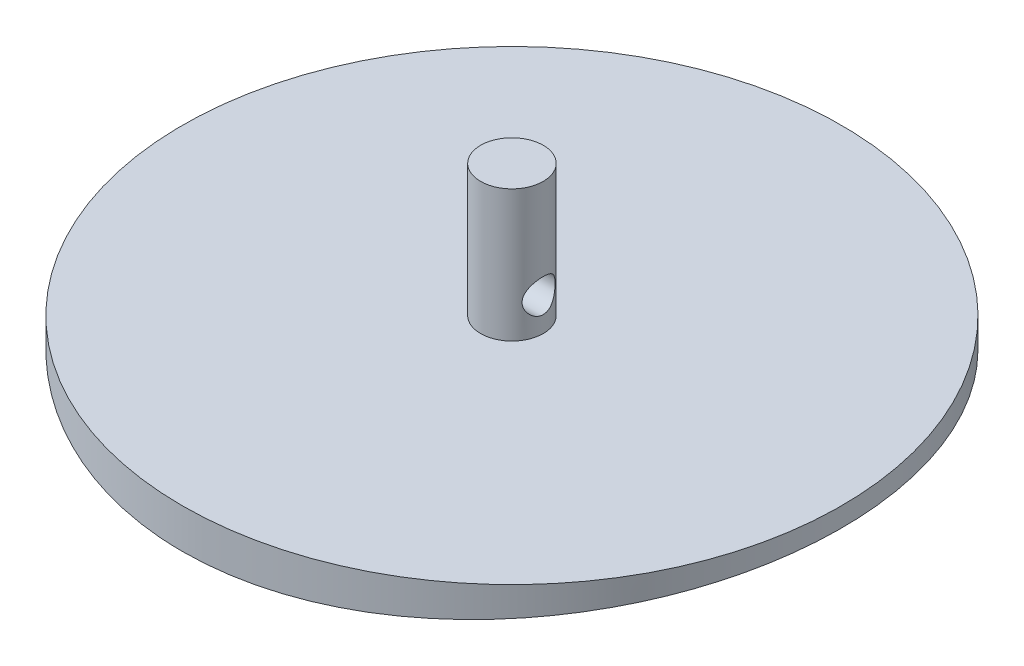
ISO-10303-21;
HEADER;
FILE_DESCRIPTION(('STEP AP214'),'2;1');
FILE_NAME('part.step','',(''),(''),'','','');
FILE_SCHEMA(('AUTOMOTIVE_DESIGN { 1 0 10303 214 1 1 1 1 }'));
ENDSEC;
DATA;
#1=APPLICATION_CONTEXT('core data for automotive mechanical design processes');
#2=APPLICATION_PROTOCOL_DEFINITION('international standard','automotive_design',2000,#1);
#3=PRODUCT_CONTEXT('',#1,'mechanical');
#4=PRODUCT('Part','Part','',(#3));
#5=PRODUCT_RELATED_PRODUCT_CATEGORY('part','',(#4));
#6=PRODUCT_DEFINITION_FORMATION('','',#4);
#7=PRODUCT_DEFINITION_CONTEXT('part definition',#1,'design');
#8=PRODUCT_DEFINITION('design','',#6,#7);
#9=PRODUCT_DEFINITION_SHAPE('','',#8);
#10=(LENGTH_UNIT() NAMED_UNIT(*) SI_UNIT(.MILLI.,.METRE.));
#11=(NAMED_UNIT(*) PLANE_ANGLE_UNIT() SI_UNIT($,.RADIAN.));
#12=(NAMED_UNIT(*) SI_UNIT($,.STERADIAN.) SOLID_ANGLE_UNIT());
#13=UNCERTAINTY_MEASURE_WITH_UNIT(LENGTH_MEASURE(1.E-05),#10,'distance_accuracy_value','');
#14=(GEOMETRIC_REPRESENTATION_CONTEXT(3) GLOBAL_UNCERTAINTY_ASSIGNED_CONTEXT((#13)) GLOBAL_UNIT_ASSIGNED_CONTEXT((#10,
#11,#12)) REPRESENTATION_CONTEXT('',''));
#15=CARTESIAN_POINT('',(0.,0.,0.));
#16=DIRECTION('',(0.,0.,1.));
#17=DIRECTION('',(1.,0.,0.));
#18=AXIS2_PLACEMENT_3D('',#15,#16,#17);
#19=CARTESIAN_POINT('',(0.,6.,0.));
#20=DIRECTION('',(0.,-1.,0.));
#21=DIRECTION('',(0.,0.,-1.));
#22=AXIS2_PLACEMENT_3D('',#19,#20,#21);
#23=CYLINDRICAL_SURFACE('',#22,50.);
#24=CARTESIAN_POINT('',(0.,6.,0.));
#25=DIRECTION('',(0.,1.,0.));
#26=DIRECTION('',(0.,0.,1.));
#27=AXIS2_PLACEMENT_3D('',#24,#25,#26);
#28=CIRCLE('',#27,50.);
#29=CARTESIAN_POINT('',(0.,6.,50.));
#30=VERTEX_POINT('',#29);
#31=EDGE_CURVE('E10',#30,#30,#28,.T.);
#32=ORIENTED_EDGE('',*,*,#31,.F.);
#33=EDGE_LOOP('',(#32));
#34=FACE_BOUND('',#33,.T.);
#35=CARTESIAN_POINT('',(0.,0.,50.));
#36=CARTESIAN_POINT('',(1.39795388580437,2.42831574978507E-06,49.999992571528));
#37=CARTESIAN_POINT('',(2.79613078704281,0.0072386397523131,49.9413223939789));
#38=CARTESIAN_POINT('',(5.58305158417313,0.0359875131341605,49.7070057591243));
#39=CARTESIAN_POINT('',(6.97179065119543,0.0575069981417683,49.5313033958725));
#40=CARTESIAN_POINT('',(9.73204390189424,0.114260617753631,49.0637366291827));
#41=CARTESIAN_POINT('',(11.1035202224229,0.149520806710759,48.7716515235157));
#42=CARTESIAN_POINT('',(13.8165716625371,0.232733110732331,48.0735291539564));
#43=CARTESIAN_POINT('',(15.1581503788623,0.280683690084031,47.6675056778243));
#44=CARTESIAN_POINT('',(17.8007431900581,0.387847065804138,46.7449476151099));
#45=CARTESIAN_POINT('',(19.101797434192,0.447048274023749,46.2285266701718));
#46=CARTESIAN_POINT('',(21.6556901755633,0.575058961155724,45.0886524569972));
#47=CARTESIAN_POINT('',(22.9085272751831,0.643868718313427,44.465196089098));
#48=CARTESIAN_POINT('',(25.3566857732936,0.78911193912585,43.1160188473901));
#49=CARTESIAN_POINT('',(26.5520320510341,0.865542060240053,42.390342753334));
#50=CARTESIAN_POINT('',(28.8775150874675,1.02389577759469,40.8416541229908));
#51=CARTESIAN_POINT('',(30.0076520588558,1.10581935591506,40.0186419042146));
#52=CARTESIAN_POINT('',(32.2002711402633,1.27326913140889,38.276787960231));
#53=CARTESIAN_POINT('',(33.2623958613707,1.35881096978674,37.3574978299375));
#54=CARTESIAN_POINT('',(35.3055348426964,1.53070447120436,35.4328784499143));
#55=CARTESIAN_POINT('',(36.2865487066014,1.61705613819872,34.4275487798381));
#56=CARTESIAN_POINT('',(38.1607026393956,1.78814404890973,32.3377623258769));
#57=CARTESIAN_POINT('',(39.0538341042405,1.87288013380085,31.2532978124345));
#58=CARTESIAN_POINT('',(40.7458370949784,2.03834231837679,29.0128823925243));
#59=CARTESIAN_POINT('',(41.5447085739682,2.11906841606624,27.8569314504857));
#60=CARTESIAN_POINT('',(43.04488702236,2.27448156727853,25.4778633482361));
#61=CARTESIAN_POINT('',(43.7458790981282,2.34914881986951,24.2545462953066));
#62=CARTESIAN_POINT('',(45.0422558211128,2.49004170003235,21.7527041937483));
#63=CARTESIAN_POINT('',(45.6376401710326,2.55626730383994,20.4741789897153));
#64=CARTESIAN_POINT('',(46.7184353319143,2.67839148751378,17.8710334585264));
#65=CARTESIAN_POINT('',(47.2038501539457,2.73429044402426,16.5464148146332));
#66=CARTESIAN_POINT('',(48.0611473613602,2.83417079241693,13.8604963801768));
#67=CARTESIAN_POINT('',(48.4330303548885,2.87815224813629,12.4991967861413));
#68=CARTESIAN_POINT('',(49.0589202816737,2.95275416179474,9.75658023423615));
#69=CARTESIAN_POINT('',(49.3135078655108,2.98344038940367,8.37539756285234));
#70=CARTESIAN_POINT('',(49.7056430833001,3.03090101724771,5.5962789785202));
#71=CARTESIAN_POINT('',(49.8431910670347,3.04767545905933,4.19834311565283));
#72=CARTESIAN_POINT('',(50.0002140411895,3.06683602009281,1.3958017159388));
#73=CARTESIAN_POINT('',(50.0196927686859,3.06922259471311,-0.00880360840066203));
#74=CARTESIAN_POINT('',(49.9404405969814,3.05954078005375,-2.81462294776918));
#75=CARTESIAN_POINT('',(49.8417100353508,3.04747243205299,-4.21583697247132));
#76=CARTESIAN_POINT('',(49.527625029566,3.00932624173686,-6.99733852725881));
#77=CARTESIAN_POINT('',(49.3128971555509,2.98332367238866,-8.37769789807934));
#78=CARTESIAN_POINT('',(48.7688165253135,2.91808726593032,-11.1153121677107));
#79=CARTESIAN_POINT('',(48.4394642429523,2.87885348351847,-12.4725671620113));
#80=CARTESIAN_POINT('',(47.6685415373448,2.78825238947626,-15.1544345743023));
#81=CARTESIAN_POINT('',(47.2269686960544,2.7368848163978,-16.4790462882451));
#82=CARTESIAN_POINT('',(46.2348131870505,2.62345171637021,-19.0863206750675));
#83=CARTESIAN_POINT('',(45.6842300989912,2.56138614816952,-20.368983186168));
#84=CARTESIAN_POINT('',(44.4764303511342,2.42811300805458,-22.8867137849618));
#85=CARTESIAN_POINT('',(43.8189391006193,2.35688199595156,-24.1216488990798));
#86=CARTESIAN_POINT('',(42.4030366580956,2.20739602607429,-26.5317902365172));
#87=CARTESIAN_POINT('',(41.6446253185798,2.12914105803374,-27.706996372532));
#88=CARTESIAN_POINT('',(40.0322643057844,1.96779475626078,-29.989500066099));
#89=CARTESIAN_POINT('',(39.1783187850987,1.88470363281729,-31.0968005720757));
#90=CARTESIAN_POINT('',(37.3808252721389,1.71599927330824,-33.2359085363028));
#91=CARTESIAN_POINT('',(36.4372770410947,1.63038603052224,-34.2677157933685));
#92=CARTESIAN_POINT('',(34.4608585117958,1.45848199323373,-36.2550071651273));
#93=CARTESIAN_POINT('',(33.4274591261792,1.37219034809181,-37.209965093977));
#94=CARTESIAN_POINT('',(31.2837558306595,1.2019145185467,-39.0295171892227));
#95=CARTESIAN_POINT('',(30.1734509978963,1.11793036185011,-39.8941102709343));
#96=CARTESIAN_POINT('',(27.8831620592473,0.954616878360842,-41.527199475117));
#97=CARTESIAN_POINT('',(26.7031452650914,0.875289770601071,-42.2956499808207));
#98=CARTESIAN_POINT('',(24.2822179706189,0.723600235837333,-43.7304666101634));
#99=CARTESIAN_POINT('',(23.0413093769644,0.651237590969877,-44.3968359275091));
#100=CARTESIAN_POINT('',(20.50581829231,0.515470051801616,-45.6234266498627));
#101=CARTESIAN_POINT('',(19.2111745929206,0.452075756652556,-46.1835227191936));
#102=CARTESIAN_POINT('',(16.5785988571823,0.336170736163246,-47.1925562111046));
#103=CARTESIAN_POINT('',(15.2406614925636,0.283661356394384,-47.6414798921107));
#104=CARTESIAN_POINT('',(12.5339035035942,0.191151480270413,-48.4239850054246));
#105=CARTESIAN_POINT('',(11.1651480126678,0.151126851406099,-48.757789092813));
#106=CARTESIAN_POINT('',(8.4045820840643,0.084628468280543,-49.3086458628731));
#107=CARTESIAN_POINT('',(7.01278319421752,0.0581481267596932,-49.5257553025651));
#108=CARTESIAN_POINT('',(4.68264484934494,0.0259288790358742,-49.7890819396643));
#109=CARTESIAN_POINT('',(3.74794373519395,0.0162174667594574,-49.8681480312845));
#110=CARTESIAN_POINT('',(1.875528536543,0.00325221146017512,-49.9736095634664));
#111=CARTESIAN_POINT('',(0.937814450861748,-1.62903055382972E-06,-50.000004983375));
#112=CARTESIAN_POINT('',(-1.39795388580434,2.4283157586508E-06,-49.9999925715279));
#113=CARTESIAN_POINT('',(-2.79613078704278,0.00723863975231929,-49.9413223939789));
#114=CARTESIAN_POINT('',(-5.5830515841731,0.0359875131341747,-49.7070057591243));
#115=CARTESIAN_POINT('',(-6.97179065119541,0.0575069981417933,-49.5313033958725));
#116=CARTESIAN_POINT('',(-9.73204390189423,0.114260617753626,-49.0637366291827));
#117=CARTESIAN_POINT('',(-11.1035202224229,0.149520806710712,-48.7716515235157));
#118=CARTESIAN_POINT('',(-13.8165716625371,0.232733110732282,-48.0735291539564));
#119=CARTESIAN_POINT('',(-15.1581503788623,0.280683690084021,-47.6675056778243));
#120=CARTESIAN_POINT('',(-17.8007431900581,0.387847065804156,-46.7449476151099));
#121=CARTESIAN_POINT('',(-19.101797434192,0.447048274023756,-46.2285266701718));
#122=CARTESIAN_POINT('',(-21.6556901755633,0.575058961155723,-45.0886524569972));
#123=CARTESIAN_POINT('',(-22.908527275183,0.643868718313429,-44.465196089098));
#124=CARTESIAN_POINT('',(-25.3566857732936,0.789111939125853,-43.1160188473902));
#125=CARTESIAN_POINT('',(-26.552032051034,0.865542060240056,-42.3903427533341));
#126=CARTESIAN_POINT('',(-28.8775150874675,1.0238957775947,-40.8416541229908));
#127=CARTESIAN_POINT('',(-30.0076520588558,1.10581935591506,-40.0186419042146));
#128=CARTESIAN_POINT('',(-32.2002711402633,1.2732691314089,-38.276787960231));
#129=CARTESIAN_POINT('',(-33.2623958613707,1.35881096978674,-37.3574978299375));
#130=CARTESIAN_POINT('',(-35.3055348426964,1.53070447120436,-35.4328784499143));
#131=CARTESIAN_POINT('',(-36.2865487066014,1.61705613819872,-34.4275487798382));
#132=CARTESIAN_POINT('',(-38.1607026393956,1.78814404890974,-32.3377623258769));
#133=CARTESIAN_POINT('',(-39.0538341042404,1.87288013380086,-31.2532978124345));
#134=CARTESIAN_POINT('',(-40.7458370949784,2.03834231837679,-29.0128823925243));
#135=CARTESIAN_POINT('',(-41.5447085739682,2.11906841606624,-27.8569314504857));
#136=CARTESIAN_POINT('',(-43.04488702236,2.27448156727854,-25.4778633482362));
#137=CARTESIAN_POINT('',(-43.7458790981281,2.34914881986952,-24.2545462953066));
#138=CARTESIAN_POINT('',(-45.0422558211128,2.49004170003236,-21.7527041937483));
#139=CARTESIAN_POINT('',(-45.6376401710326,2.55626730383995,-20.4741789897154));
#140=CARTESIAN_POINT('',(-46.7184353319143,2.67839148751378,-17.8710334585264));
#141=CARTESIAN_POINT('',(-47.2038501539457,2.73429044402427,-16.5464148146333));
#142=CARTESIAN_POINT('',(-48.0611473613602,2.83417079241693,-13.8604963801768));
#143=CARTESIAN_POINT('',(-48.4330303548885,2.8781522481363,-12.4991967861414));
#144=CARTESIAN_POINT('',(-49.0589202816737,2.95275416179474,-9.75658023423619));
#145=CARTESIAN_POINT('',(-49.3135078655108,2.98344038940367,-8.37539756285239));
#146=CARTESIAN_POINT('',(-49.7056430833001,3.03090101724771,-5.59627897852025));
#147=CARTESIAN_POINT('',(-49.8431910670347,3.04767545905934,-4.19834311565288));
#148=CARTESIAN_POINT('',(-50.0002140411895,3.06683602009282,-1.39580171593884));
#149=CARTESIAN_POINT('',(-50.0196927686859,3.06922259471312,0.00880360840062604));
#150=CARTESIAN_POINT('',(-49.9404405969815,3.05954078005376,2.81462294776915));
#151=CARTESIAN_POINT('',(-49.8417100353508,3.04747243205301,4.21583697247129));
#152=CARTESIAN_POINT('',(-49.527625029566,3.00932624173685,6.99733852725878));
#153=CARTESIAN_POINT('',(-49.3128971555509,2.9833236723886,8.37769789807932));
#154=CARTESIAN_POINT('',(-48.7688165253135,2.91808726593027,11.1153121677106));
#155=CARTESIAN_POINT('',(-48.4394642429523,2.87885348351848,12.4725671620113));
#156=CARTESIAN_POINT('',(-47.6685415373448,2.78825238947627,15.1544345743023));
#157=CARTESIAN_POINT('',(-47.2269686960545,2.73688481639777,16.4790462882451));
#158=CARTESIAN_POINT('',(-46.2348131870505,2.62345171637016,19.0863206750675));
#159=CARTESIAN_POINT('',(-45.6842300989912,2.5613861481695,20.368983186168));
#160=CARTESIAN_POINT('',(-44.4764303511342,2.42811300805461,22.8867137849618));
#161=CARTESIAN_POINT('',(-43.8189391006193,2.35688199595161,24.1216488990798));
#162=CARTESIAN_POINT('',(-42.4030366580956,2.20739602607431,26.5317902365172));
#163=CARTESIAN_POINT('',(-41.6446253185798,2.1291410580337,27.7069963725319));
#164=CARTESIAN_POINT('',(-40.0322643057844,1.96779475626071,29.989500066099));
#165=CARTESIAN_POINT('',(-39.1783187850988,1.88470363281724,31.0968005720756));
#166=CARTESIAN_POINT('',(-37.380825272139,1.71599927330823,33.2359085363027));
#167=CARTESIAN_POINT('',(-36.4372770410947,1.63038603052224,34.2677157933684));
#168=CARTESIAN_POINT('',(-34.4608585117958,1.45848199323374,36.2550071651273));
#169=CARTESIAN_POINT('',(-33.4274591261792,1.37219034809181,37.209965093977));
#170=CARTESIAN_POINT('',(-31.2837558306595,1.20191451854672,39.0295171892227));
#171=CARTESIAN_POINT('',(-30.1734509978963,1.11793036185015,39.8941102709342));
#172=CARTESIAN_POINT('',(-27.8831620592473,0.954616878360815,41.527199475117));
#173=CARTESIAN_POINT('',(-26.7031452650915,0.875289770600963,42.2956499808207));
#174=CARTESIAN_POINT('',(-24.2822179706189,0.723600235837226,43.7304666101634));
#175=CARTESIAN_POINT('',(-23.0413093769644,0.651237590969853,44.3968359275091));
#176=CARTESIAN_POINT('',(-20.5058182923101,0.515470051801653,45.6234266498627));
#177=CARTESIAN_POINT('',(-19.2111745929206,0.452075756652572,46.1835227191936));
#178=CARTESIAN_POINT('',(-16.5785988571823,0.336170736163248,47.1925562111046));
#179=CARTESIAN_POINT('',(-15.2406614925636,0.283661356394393,47.6414798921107));
#180=CARTESIAN_POINT('',(-12.5339035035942,0.191151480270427,48.4239850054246));
#181=CARTESIAN_POINT('',(-11.1651480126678,0.151126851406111,48.757789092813));
#182=CARTESIAN_POINT('',(-8.40458208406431,0.0846284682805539,49.3086458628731));
#183=CARTESIAN_POINT('',(-7.01278319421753,0.0581481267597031,49.5257553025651));
#184=CARTESIAN_POINT('',(-4.68264484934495,0.0259288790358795,49.7890819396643));
#185=CARTESIAN_POINT('',(-3.74794373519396,0.0162174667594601,49.8681480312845));
#186=CARTESIAN_POINT('',(-1.875528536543,0.0032522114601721,49.9736095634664));
#187=CARTESIAN_POINT('',(-0.93781445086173,-1.6290305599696E-06,50.000004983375));
#188=CARTESIAN_POINT('',(0.,0.,50.));
#189=B_SPLINE_CURVE_WITH_KNOTS('',3,(#35,#36,#37,#38,#39,#40,#41,#42,#43,#44,#45,#46,#47,#48,
#49,#50,#51,#52,#53,#54,#55,#56,#57,#58,#59,#60,#61,#62,#63,#64,#65,#66,#67,#68,#69,#70,#71,#72,
#73,#74,#75,#76,#77,#78,#79,#80,#81,#82,#83,#84,#85,#86,#87,#88,#89,#90,#91,#92,#93,#94,#95,#96,
#97,#98,#99,#100,#101,#102,#103,#104,#105,#106,#107,#108,#109,#110,#111,#112,#113,#114,#115,
#116,#117,#118,#119,#120,#121,#122,#123,#124,#125,#126,#127,#128,#129,#130,#131,#132,#133,#134,
#135,#136,#137,#138,#139,#140,#141,#142,#143,#144,#145,#146,#147,#148,#149,#150,#151,#152,#153,
#154,#155,#156,#157,#158,#159,#160,#161,#162,#163,#164,#165,#166,#167,#168,#169,#170,#171,#172,
#173,#174,#175,#176,#177,#178,#179,#180,#181,#182,#183,#184,#185,#186,#187,#188),.UNSPECIFIED.,
.T.,.F.,(4,2,2,2,2,2,2,2,2,2,2,2,2,2,2,2,2,2,2,2,2,2,2,2,2,2,2,2,2,2,2,2,2,2,2,2,2,2,2,2,2,2,2,
2,2,2,2,2,2,2,2,2,2,2,2,2,2,2,2,2,2,2,2,2,2,2,2,2,2,2,2,2,2,2,2,2,4),(0.,4.1930012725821,
8.38800696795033,12.5910060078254,16.7934966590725,20.9916819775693,25.1899888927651,
29.38646232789,33.5829220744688,37.7998775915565,42.0168537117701,46.2342422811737,
50.4516329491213,54.6822935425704,58.9129660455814,63.1434842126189,67.3739797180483,
71.5833017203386,75.7926111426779,80.0017873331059,84.2109515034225,88.397603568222,
92.5842383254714,96.770963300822,100.957704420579,105.155374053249,109.353049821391,
113.550543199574,117.748047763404,121.972203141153,126.196409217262,130.422612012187,
134.648682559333,138.879706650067,143.111253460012,147.334569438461,151.555829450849,
154.368694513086,157.1815606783,161.374561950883,165.569567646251,169.772566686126,
173.975057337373,178.17324265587,182.371549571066,186.56802300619,190.764482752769,
194.981438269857,199.198414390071,203.415802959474,207.633193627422,211.863854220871,
216.094526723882,220.325044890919,224.555540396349,228.764862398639,232.974171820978,
237.183348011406,241.392512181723,245.579164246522,249.765799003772,253.952523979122,
258.13926509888,262.33693473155,266.534610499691,270.732103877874,274.929608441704,
279.153763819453,283.377969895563,287.604172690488,291.830243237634,296.061267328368,
300.292814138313,304.516130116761,308.73739012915,311.550255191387,314.363121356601),.UNSPECIFIED.);
#190=CARTESIAN_POINT('',(0.,0.,50.));
#191=VERTEX_POINT('',#190);
#192=EDGE_CURVE('E71',#191,#191,#189,.T.);
#193=ORIENTED_EDGE('',*,*,#192,.T.);
#194=EDGE_LOOP('',(#193));
#195=FACE_BOUND('',#194,.T.);
#196=ADVANCED_FACE('F30',(#34,#195),#23,.T.);
#197=CARTESIAN_POINT('',(0.,6.,0.));
#198=DIRECTION('',(0.,1.,0.));
#199=DIRECTION('',(0.,0.,1.));
#200=AXIS2_PLACEMENT_3D('',#197,#198,#199);
#201=PLANE('',#200);
#202=CARTESIAN_POINT('',(0.,6.,0.));
#203=DIRECTION('',(0.,1.,0.));
#204=DIRECTION('',(0.,0.,1.));
#205=AXIS2_PLACEMENT_3D('',#202,#203,#204);
#206=CIRCLE('',#205,4.75);
#207=CARTESIAN_POINT('',(0.,6.,4.75));
#208=VERTEX_POINT('',#207);
#209=EDGE_CURVE('E40',#208,#208,#206,.T.);
#210=ORIENTED_EDGE('',*,*,#209,.F.);
#211=EDGE_LOOP('',(#210));
#212=FACE_BOUND('',#211,.T.);
#213=ORIENTED_EDGE('',*,*,#31,.T.);
#214=EDGE_LOOP('',(#213));
#215=FACE_BOUND('',#214,.T.);
#216=ADVANCED_FACE('F87',(#212,#215),#201,.T.);
#217=CARTESIAN_POINT('',(0.,26.,0.));
#218=DIRECTION('',(0.,-1.,0.));
#219=DIRECTION('',(0.,0.,-1.));
#220=AXIS2_PLACEMENT_3D('',#217,#218,#219);
#221=CYLINDRICAL_SURFACE('',#220,4.75);
#222=CARTESIAN_POINT('',(-4.03887360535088,11.,-2.5));
#223=CARTESIAN_POINT('',(-4.03888812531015,10.8708326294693,-2.49998867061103));
#224=CARTESIAN_POINT('',(-4.04516698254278,10.7415216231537,-2.48992023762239));
#225=CARTESIAN_POINT('',(-4.06934094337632,10.4869608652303,-2.45019726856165));
#226=CARTESIAN_POINT('',(-4.0872578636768,10.3617192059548,-2.42050594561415));
#227=CARTESIAN_POINT('',(-4.13203590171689,10.1194687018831,-2.34323316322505));
#228=CARTESIAN_POINT('',(-4.15884524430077,10.0024168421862,-2.29575506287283));
#229=CARTESIAN_POINT('',(-4.21830577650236,9.77797525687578,-2.18457313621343));
#230=CARTESIAN_POINT('',(-4.25095778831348,9.67058689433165,-2.1208670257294));
#231=CARTESIAN_POINT('',(-4.32208279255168,9.45763589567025,-1.97217898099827));
#232=CARTESIAN_POINT('',(-4.36081495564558,9.35314933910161,-1.88577924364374));
#233=CARTESIAN_POINT('',(-4.43765175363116,9.15929902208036,-1.69709440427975));
#234=CARTESIAN_POINT('',(-4.47575603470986,9.0699435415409,-1.59480066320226));
#235=CARTESIAN_POINT('',(-4.55053297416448,8.90216311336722,-1.36766138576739));
#236=CARTESIAN_POINT('',(-4.58687169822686,8.82510208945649,-1.2416879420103));
#237=CARTESIAN_POINT('',(-4.65058284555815,8.6937634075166,-0.976291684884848));
#238=CARTESIAN_POINT('',(-4.67796152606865,8.63946984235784,-0.836878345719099));
#239=CARTESIAN_POINT('',(-4.71878653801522,8.55960499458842,-0.559994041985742));
#240=CARTESIAN_POINT('',(-4.73314764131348,8.53213497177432,-0.423208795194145));
#241=CARTESIAN_POINT('',(-4.74976768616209,8.50040258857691,-0.14627953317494));
#242=CARTESIAN_POINT('',(-4.75203488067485,8.49612440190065,-0.00613787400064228));
#243=CARTESIAN_POINT('',(-4.74460623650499,8.51026004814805,0.259076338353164));
#244=CARTESIAN_POINT('',(-4.73603922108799,8.52653247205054,0.384302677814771));
#245=CARTESIAN_POINT('',(-4.70966402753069,8.57741709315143,0.629940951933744));
#246=CARTESIAN_POINT('',(-4.69185514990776,8.61203067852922,0.750352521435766));
#247=CARTESIAN_POINT('',(-4.64832397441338,8.69873205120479,0.984887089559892));
#248=CARTESIAN_POINT('',(-4.62250593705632,8.75103197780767,1.09891315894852));
#249=CARTESIAN_POINT('',(-4.56521547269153,8.87127174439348,1.31682178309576));
#250=CARTESIAN_POINT('',(-4.53374111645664,8.93921692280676,1.42070085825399));
#251=CARTESIAN_POINT('',(-4.46424376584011,9.09672207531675,1.62665505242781));
#252=CARTESIAN_POINT('',(-4.4258803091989,9.18777760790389,1.7274720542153));
#253=CARTESIAN_POINT('',(-4.34886115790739,9.38496579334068,1.91312023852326));
#254=CARTESIAN_POINT('',(-4.31020522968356,9.49111205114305,1.99793683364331));
#255=CARTESIAN_POINT('',(-4.23372124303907,9.72523150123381,2.15553900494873));
#256=CARTESIAN_POINT('',(-4.19617792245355,9.85424919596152,2.22692574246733));
#257=CARTESIAN_POINT('',(-4.13053185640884,10.1248361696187,2.34646513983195));
#258=CARTESIAN_POINT('',(-4.10241855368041,10.2663911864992,2.39464380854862));
#259=CARTESIAN_POINT('',(-4.0621422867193,10.5460917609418,2.46230513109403));
#260=CARTESIAN_POINT('',(-4.04887181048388,10.6835847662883,2.48379603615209));
#261=CARTESIAN_POINT('',(-4.03669887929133,10.9608122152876,2.50354258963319));
#262=CARTESIAN_POINT('',(-4.0377834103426,11.1005445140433,2.50181928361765));
#263=CARTESIAN_POINT('',(-4.05301938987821,11.3592088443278,2.47702872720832));
#264=CARTESIAN_POINT('',(-4.06548746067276,11.4785217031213,2.45671037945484));
#265=CARTESIAN_POINT('',(-4.09948530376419,11.7117640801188,2.39954535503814));
#266=CARTESIAN_POINT('',(-4.12101847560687,11.8256915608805,2.36269247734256));
#267=CARTESIAN_POINT('',(-4.17182553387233,12.0508178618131,2.27182388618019));
#268=CARTESIAN_POINT('',(-4.20140382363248,12.1616639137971,2.21711124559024));
#269=CARTESIAN_POINT('',(-4.26475454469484,12.3732596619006,2.09266397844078));
#270=CARTESIAN_POINT('',(-4.29852912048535,12.4740041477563,2.02292165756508));
#271=CARTESIAN_POINT('',(-4.37224571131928,12.677582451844,1.85880518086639));
#272=CARTESIAN_POINT('',(-4.41238048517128,12.7786662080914,1.76233682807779));
#273=CARTESIAN_POINT('',(-4.49022284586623,12.9638391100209,1.55333112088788));
#274=CARTESIAN_POINT('',(-4.52792930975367,13.0479204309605,1.44078640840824));
#275=CARTESIAN_POINT('',(-4.59846981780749,13.1995691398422,1.19717863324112));
#276=CARTESIAN_POINT('',(-4.63106381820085,13.2663862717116,1.06557381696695));
#277=CARTESIAN_POINT('',(-4.68579907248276,13.3762351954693,0.790784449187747));
#278=CARTESIAN_POINT('',(-4.70795042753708,13.4192899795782,0.647611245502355));
#279=CARTESIAN_POINT('',(-4.73753030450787,13.4763319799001,0.368802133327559));
#280=CARTESIAN_POINT('',(-4.74618361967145,13.4927437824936,0.233792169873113));
#281=CARTESIAN_POINT('',(-4.75178452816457,13.5033946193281,-0.0373205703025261));
#282=CARTESIAN_POINT('',(-4.74873720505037,13.4976432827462,-0.173422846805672));
#283=CARTESIAN_POINT('',(-4.73197968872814,13.4656214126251,-0.431647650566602));
#284=CARTESIAN_POINT('',(-4.71911732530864,13.4409817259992,-0.554034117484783));
#285=CARTESIAN_POINT('',(-4.68494300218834,13.3742390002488,-0.792683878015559));
#286=CARTESIAN_POINT('',(-4.66362994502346,13.3321336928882,-0.908946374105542));
#287=CARTESIAN_POINT('',(-4.61340184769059,13.2300282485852,-1.13719680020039));
#288=CARTESIAN_POINT('',(-4.58422279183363,13.1693943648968,-1.2488412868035));
#289=CARTESIAN_POINT('',(-4.52115438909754,13.0327352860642,-1.46079086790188));
#290=CARTESIAN_POINT('',(-4.48726297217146,12.9567033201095,-1.56109094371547));
#291=CARTESIAN_POINT('',(-4.41370181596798,12.7819113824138,-1.75899072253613));
#292=CARTESIAN_POINT('',(-4.37380365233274,12.6815823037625,-1.85512377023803));
#293=CARTESIAN_POINT('',(-4.29551859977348,12.4659799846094,-2.02982818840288));
#294=CARTESIAN_POINT('',(-4.25713334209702,12.3506911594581,-2.1083810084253));
#295=CARTESIAN_POINT('',(-4.18450138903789,12.1010877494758,-2.24923532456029));
#296=CARTESIAN_POINT('',(-4.15054906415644,11.9661182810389,-2.31055366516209));
#297=CARTESIAN_POINT('',(-4.10841467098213,11.7558464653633,-2.38415996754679));
#298=CARTESIAN_POINT('',(-4.09584271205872,11.6845186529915,-2.40562277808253));
#299=CARTESIAN_POINT('',(-4.07415373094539,11.5397533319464,-2.4421765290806));
#300=CARTESIAN_POINT('',(-4.06503439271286,11.466317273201,-2.45727174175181));
#301=CARTESIAN_POINT('',(-4.05162249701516,11.3275397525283,-2.47931450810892));
#302=CARTESIAN_POINT('',(-4.04686058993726,11.2623693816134,-2.48705924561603));
#303=CARTESIAN_POINT('',(-4.04048236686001,11.1314784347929,-2.49740500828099));
#304=CARTESIAN_POINT('',(-4.03886621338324,11.0657578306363,-2.50000576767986));
#305=CARTESIAN_POINT('',(-4.03887360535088,11.,-2.5));
#306=B_SPLINE_CURVE_WITH_KNOTS('',3,(#222,#223,#224,#225,#226,#227,#228,#229,#230,#231,#232,
#233,#234,#235,#236,#237,#238,#239,#240,#241,#242,#243,#244,#245,#246,#247,#248,#249,#250,#251,
#252,#253,#254,#255,#256,#257,#258,#259,#260,#261,#262,#263,#264,#265,#266,#267,#268,#269,#270,
#271,#272,#273,#274,#275,#276,#277,#278,#279,#280,#281,#282,#283,#284,#285,#286,#287,#288,#289,
#290,#291,#292,#293,#294,#295,#296,#297,#298,#299,#300,#301,#302,#303,#304,#305),.UNSPECIFIED.,
.T.,.F.,(4,2,2,2,2,2,2,2,2,2,2,2,2,2,2,2,2,2,2,2,2,2,2,2,2,2,2,2,2,2,2,2,2,2,2,2,2,2,2,2,2,4),
(0.,0.387234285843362,0.775196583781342,1.1609385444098,1.54673483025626,1.96800967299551,
2.38951430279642,2.84334634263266,3.29686076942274,3.71525319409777,4.13336006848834,
4.51128274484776,4.88923402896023,5.2718896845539,5.65467610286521,6.07639598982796,
6.49849851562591,6.95258898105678,7.40616936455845,7.82301029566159,8.23947335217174,
8.60284625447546,8.96635554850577,9.34620245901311,9.72624429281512,10.1604713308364,
10.5948977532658,11.0458572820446,11.4963796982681,11.9029807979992,12.3094052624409,
12.6842167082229,13.059076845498,13.4485537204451,13.8382022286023,14.2700145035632,
14.7022802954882,15.1556952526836,15.3820075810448,15.6081678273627,15.805294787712,
16.0024319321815),.UNSPECIFIED.);
#307=CARTESIAN_POINT('',(-4.03887360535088,11.,-2.5));
#308=VERTEX_POINT('',#307);
#309=EDGE_CURVE('E45',#308,#308,#306,.T.);
#310=ORIENTED_EDGE('',*,*,#309,.F.);
#311=EDGE_LOOP('',(#310));
#312=FACE_BOUND('',#311,.T.);
#313=CARTESIAN_POINT('',(4.03887360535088,11.,-2.5));
#314=CARTESIAN_POINT('',(4.03888812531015,11.1291673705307,-2.49998867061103));
#315=CARTESIAN_POINT('',(4.04516698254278,11.2584783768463,-2.48992023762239));
#316=CARTESIAN_POINT('',(4.06934094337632,11.5130391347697,-2.45019726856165));
#317=CARTESIAN_POINT('',(4.0872578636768,11.6382807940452,-2.42050594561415));
#318=CARTESIAN_POINT('',(4.13203590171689,11.8805312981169,-2.34323316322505));
#319=CARTESIAN_POINT('',(4.15884524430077,11.9975831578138,-2.29575506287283));
#320=CARTESIAN_POINT('',(4.21830577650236,12.2220247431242,-2.18457313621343));
#321=CARTESIAN_POINT('',(4.25095778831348,12.3294131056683,-2.1208670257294));
#322=CARTESIAN_POINT('',(4.32208279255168,12.5423641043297,-1.97217898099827));
#323=CARTESIAN_POINT('',(4.36081495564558,12.6468506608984,-1.88577924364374));
#324=CARTESIAN_POINT('',(4.43765175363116,12.8407009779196,-1.69709440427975));
#325=CARTESIAN_POINT('',(4.47575603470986,12.9300564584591,-1.59480066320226));
#326=CARTESIAN_POINT('',(4.55053297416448,13.0978368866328,-1.36766138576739));
#327=CARTESIAN_POINT('',(4.58687169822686,13.1748979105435,-1.2416879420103));
#328=CARTESIAN_POINT('',(4.65058284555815,13.3062365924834,-0.976291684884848));
#329=CARTESIAN_POINT('',(4.67796152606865,13.3605301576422,-0.836878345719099));
#330=CARTESIAN_POINT('',(4.71878653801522,13.4403950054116,-0.559994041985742));
#331=CARTESIAN_POINT('',(4.73314764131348,13.4678650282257,-0.423208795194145));
#332=CARTESIAN_POINT('',(4.74976768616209,13.4995974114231,-0.14627953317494));
#333=CARTESIAN_POINT('',(4.75203488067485,13.5038755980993,-0.00613787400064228));
#334=CARTESIAN_POINT('',(4.74460623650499,13.4897399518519,0.259076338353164));
#335=CARTESIAN_POINT('',(4.73603922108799,13.4734675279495,0.384302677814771));
#336=CARTESIAN_POINT('',(4.70966402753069,13.4225829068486,0.629940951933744));
#337=CARTESIAN_POINT('',(4.69185514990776,13.3879693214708,0.750352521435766));
#338=CARTESIAN_POINT('',(4.64832397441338,13.3012679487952,0.984887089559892));
#339=CARTESIAN_POINT('',(4.62250593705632,13.2489680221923,1.09891315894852));
#340=CARTESIAN_POINT('',(4.56521547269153,13.1287282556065,1.31682178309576));
#341=CARTESIAN_POINT('',(4.53374111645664,13.0607830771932,1.42070085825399));
#342=CARTESIAN_POINT('',(4.46424376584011,12.9032779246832,1.62665505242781));
#343=CARTESIAN_POINT('',(4.4258803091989,12.8122223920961,1.7274720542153));
#344=CARTESIAN_POINT('',(4.34886115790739,12.6150342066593,1.91312023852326));
#345=CARTESIAN_POINT('',(4.31020522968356,12.5088879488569,1.99793683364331));
#346=CARTESIAN_POINT('',(4.23372124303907,12.2747684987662,2.15553900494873));
#347=CARTESIAN_POINT('',(4.19617792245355,12.1457508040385,2.22692574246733));
#348=CARTESIAN_POINT('',(4.13053185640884,11.8751638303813,2.34646513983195));
#349=CARTESIAN_POINT('',(4.10241855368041,11.7336088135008,2.39464380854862));
#350=CARTESIAN_POINT('',(4.0621422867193,11.4539082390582,2.46230513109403));
#351=CARTESIAN_POINT('',(4.04887181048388,11.3164152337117,2.48379603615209));
#352=CARTESIAN_POINT('',(4.03669887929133,11.0391877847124,2.50354258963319));
#353=CARTESIAN_POINT('',(4.0377834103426,10.8994554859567,2.50181928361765));
#354=CARTESIAN_POINT('',(4.05301938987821,10.6407911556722,2.47702872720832));
#355=CARTESIAN_POINT('',(4.06548746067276,10.5214782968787,2.45671037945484));
#356=CARTESIAN_POINT('',(4.09948530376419,10.2882359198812,2.39954535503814));
#357=CARTESIAN_POINT('',(4.12101847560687,10.1743084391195,2.36269247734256));
#358=CARTESIAN_POINT('',(4.17182553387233,9.94918213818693,2.27182388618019));
#359=CARTESIAN_POINT('',(4.20140382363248,9.83833608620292,2.21711124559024));
#360=CARTESIAN_POINT('',(4.26475454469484,9.62674033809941,2.09266397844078));
#361=CARTESIAN_POINT('',(4.29852912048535,9.52599585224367,2.02292165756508));
#362=CARTESIAN_POINT('',(4.37224571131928,9.32241754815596,1.85880518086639));
#363=CARTESIAN_POINT('',(4.41238048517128,9.22133379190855,1.76233682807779));
#364=CARTESIAN_POINT('',(4.49022284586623,9.03616088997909,1.55333112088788));
#365=CARTESIAN_POINT('',(4.52792930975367,8.95207956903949,1.44078640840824));
#366=CARTESIAN_POINT('',(4.59846981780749,8.80043086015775,1.19717863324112));
#367=CARTESIAN_POINT('',(4.63106381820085,8.73361372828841,1.06557381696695));
#368=CARTESIAN_POINT('',(4.68579907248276,8.6237648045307,0.790784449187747));
#369=CARTESIAN_POINT('',(4.70795042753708,8.58071002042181,0.647611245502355));
#370=CARTESIAN_POINT('',(4.73753030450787,8.52366802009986,0.368802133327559));
#371=CARTESIAN_POINT('',(4.74618361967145,8.5072562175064,0.233792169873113));
#372=CARTESIAN_POINT('',(4.75178452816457,8.49660538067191,-0.0373205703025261));
#373=CARTESIAN_POINT('',(4.74873720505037,8.50235671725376,-0.173422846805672));
#374=CARTESIAN_POINT('',(4.73197968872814,8.53437858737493,-0.431647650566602));
#375=CARTESIAN_POINT('',(4.71911732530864,8.55901827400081,-0.554034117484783));
#376=CARTESIAN_POINT('',(4.68494300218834,8.62576099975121,-0.792683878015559));
#377=CARTESIAN_POINT('',(4.66362994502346,8.66786630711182,-0.908946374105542));
#378=CARTESIAN_POINT('',(4.61340184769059,8.76997175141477,-1.13719680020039));
#379=CARTESIAN_POINT('',(4.58422279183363,8.83060563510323,-1.2488412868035));
#380=CARTESIAN_POINT('',(4.52115438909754,8.96726471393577,-1.46079086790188));
#381=CARTESIAN_POINT('',(4.48726297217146,9.04329667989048,-1.56109094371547));
#382=CARTESIAN_POINT('',(4.41370181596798,9.21808861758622,-1.75899072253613));
#383=CARTESIAN_POINT('',(4.37380365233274,9.31841769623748,-1.85512377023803));
#384=CARTESIAN_POINT('',(4.29551859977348,9.53402001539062,-2.02982818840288));
#385=CARTESIAN_POINT('',(4.25713334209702,9.64930884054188,-2.1083810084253));
#386=CARTESIAN_POINT('',(4.18450138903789,9.89891225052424,-2.24923532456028));
#387=CARTESIAN_POINT('',(4.15054906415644,10.0338817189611,-2.31055366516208));
#388=CARTESIAN_POINT('',(4.10841467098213,10.2441535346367,-2.38415996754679));
#389=CARTESIAN_POINT('',(4.09584271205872,10.3154813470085,-2.40562277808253));
#390=CARTESIAN_POINT('',(4.07415373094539,10.4602466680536,-2.4421765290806));
#391=CARTESIAN_POINT('',(4.06503439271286,10.533682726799,-2.45727174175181));
#392=CARTESIAN_POINT('',(4.05162249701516,10.6724602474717,-2.47931450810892));
#393=CARTESIAN_POINT('',(4.04686058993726,10.7376306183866,-2.48705924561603));
#394=CARTESIAN_POINT('',(4.04048236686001,10.8685215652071,-2.49740500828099));
#395=CARTESIAN_POINT('',(4.03886621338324,10.9342421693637,-2.50000576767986));
#396=CARTESIAN_POINT('',(4.03887360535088,11.,-2.5));
#397=B_SPLINE_CURVE_WITH_KNOTS('',3,(#313,#314,#315,#316,#317,#318,#319,#320,#321,#322,#323,
#324,#325,#326,#327,#328,#329,#330,#331,#332,#333,#334,#335,#336,#337,#338,#339,#340,#341,#342,
#343,#344,#345,#346,#347,#348,#349,#350,#351,#352,#353,#354,#355,#356,#357,#358,#359,#360,#361,
#362,#363,#364,#365,#366,#367,#368,#369,#370,#371,#372,#373,#374,#375,#376,#377,#378,#379,#380,
#381,#382,#383,#384,#385,#386,#387,#388,#389,#390,#391,#392,#393,#394,#395,#396),.UNSPECIFIED.,
.T.,.F.,(4,2,2,2,2,2,2,2,2,2,2,2,2,2,2,2,2,2,2,2,2,2,2,2,2,2,2,2,2,2,2,2,2,2,2,2,2,2,2,2,2,4),
(0.,0.387234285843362,0.775196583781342,1.1609385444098,1.54673483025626,1.96800967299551,
2.38951430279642,2.84334634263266,3.29686076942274,3.71525319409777,4.13336006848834,
4.51128274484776,4.88923402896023,5.2718896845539,5.65467610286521,6.07639598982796,
6.49849851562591,6.95258898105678,7.40616936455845,7.82301029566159,8.23947335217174,
8.60284625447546,8.96635554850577,9.34620245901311,9.72624429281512,10.1604713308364,
10.5948977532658,11.0458572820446,11.4963796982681,11.9029807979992,12.3094052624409,
12.6842167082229,13.059076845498,13.4485537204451,13.8382022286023,14.2700145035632,
14.7022802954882,15.1556952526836,15.3820075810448,15.6081678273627,15.805294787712,
16.0024319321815),.UNSPECIFIED.);
#398=CARTESIAN_POINT('',(4.03887360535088,11.,-2.5));
#399=VERTEX_POINT('',#398);
#400=EDGE_CURVE('E54',#399,#399,#397,.T.);
#401=ORIENTED_EDGE('',*,*,#400,.F.);
#402=EDGE_LOOP('',(#401));
#403=FACE_BOUND('',#402,.T.);
#404=CARTESIAN_POINT('',(0.,26.,0.));
#405=DIRECTION('',(0.,1.,0.));
#406=DIRECTION('',(0.,0.,1.));
#407=AXIS2_PLACEMENT_3D('',#404,#405,#406);
#408=CIRCLE('',#407,4.75);
#409=CARTESIAN_POINT('',(0.,26.,4.75));
#410=VERTEX_POINT('',#409);
#411=EDGE_CURVE('E36',#410,#410,#408,.T.);
#412=ORIENTED_EDGE('',*,*,#411,.F.);
#413=EDGE_LOOP('',(#412));
#414=FACE_BOUND('',#413,.T.);
#415=ORIENTED_EDGE('',*,*,#209,.T.);
#416=EDGE_LOOP('',(#415));
#417=FACE_BOUND('',#416,.T.);
#418=ADVANCED_FACE('F83',(#312,#403,#414,#417),#221,.T.);
#419=CARTESIAN_POINT('',(0.,26.,0.));
#420=DIRECTION('',(0.,1.,0.));
#421=DIRECTION('',(0.,0.,1.));
#422=AXIS2_PLACEMENT_3D('',#419,#420,#421);
#423=PLANE('',#422);
#424=ORIENTED_EDGE('',*,*,#411,.T.);
#425=EDGE_LOOP('',(#424));
#426=FACE_BOUND('',#425,.T.);
#427=ADVANCED_FACE('F86',(#426),#423,.T.);
#428=CARTESIAN_POINT('',(-50.001,11.,0.));
#429=DIRECTION('',(1.,0.,0.));
#430=DIRECTION('',(0.,0.,-1.));
#431=AXIS2_PLACEMENT_3D('',#428,#429,#430);
#432=CYLINDRICAL_SURFACE('',#431,2.5);
#433=ORIENTED_EDGE('',*,*,#400,.T.);
#434=EDGE_LOOP('',(#433));
#435=FACE_BOUND('',#434,.T.);
#436=ORIENTED_EDGE('',*,*,#309,.T.);
#437=EDGE_LOOP('',(#436));
#438=FACE_BOUND('',#437,.T.);
#439=ADVANCED_FACE('F59',(#435,#438),#432,.F.);
#440=CARTESIAN_POINT('',(50.001,-406.055264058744,0.));
#441=DIRECTION('',(-1.,0.,0.));
#442=DIRECTION('',(0.,0.,1.));
#443=AXIS2_PLACEMENT_3D('',#440,#441,#442);
#444=CYLINDRICAL_SURFACE('',#443,409.122081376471);
#445=ORIENTED_EDGE('',*,*,#192,.F.);
#446=EDGE_LOOP('',(#445));
#447=FACE_BOUND('',#446,.T.);
#448=ADVANCED_FACE('F64',(#447),#444,.F.);
#449=CLOSED_SHELL('',(#196,#216,#418,#427,#439,#448));
#450=MANIFOLD_SOLID_BREP('B2',#449);
#451=ADVANCED_BREP_SHAPE_REPRESENTATION('',(#18,#450),#14);
#452=SHAPE_DEFINITION_REPRESENTATION(#9,#451);
ENDSEC;
END-ISO-10303-21;
